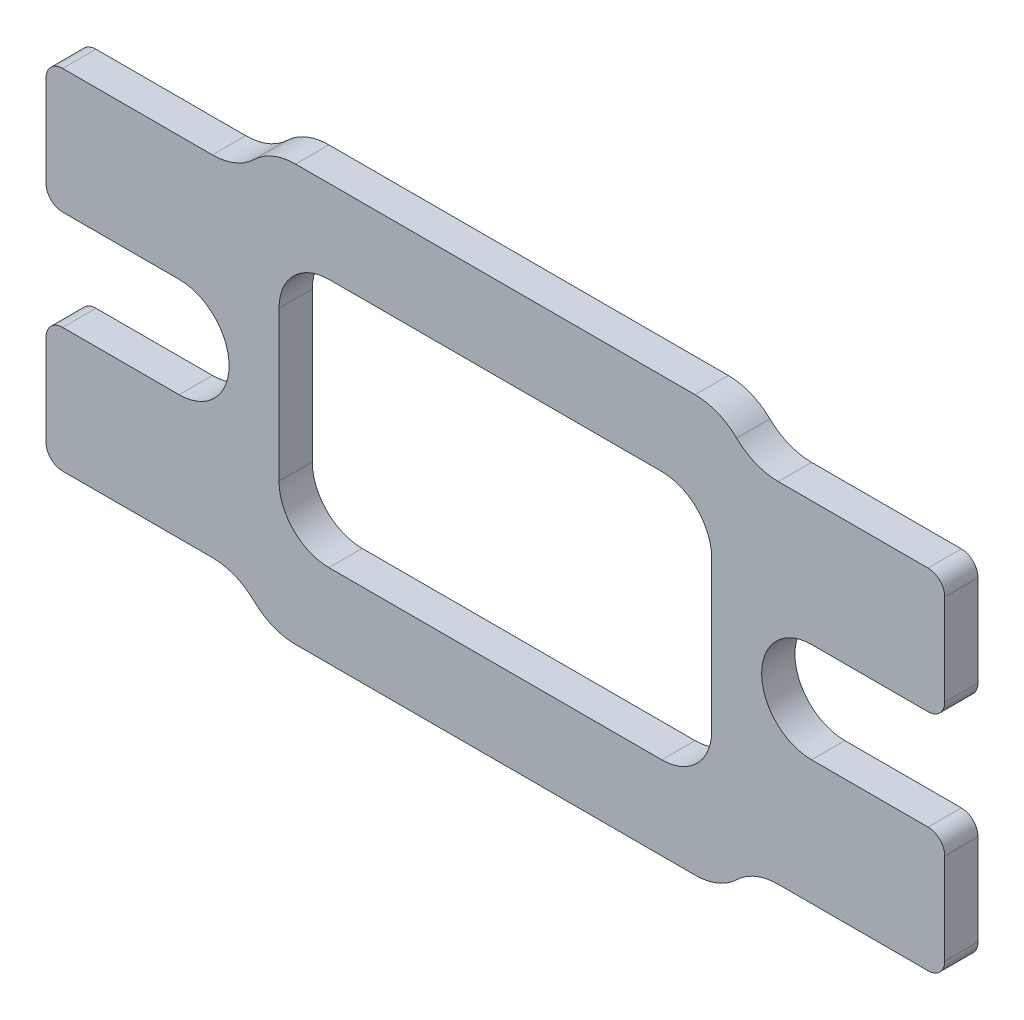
ISO-10303-21;
HEADER;
FILE_DESCRIPTION(('STEP AP214'),'2;1');
FILE_NAME('part.step','',(''),(''),'','','');
FILE_SCHEMA(('AUTOMOTIVE_DESIGN { 1 0 10303 214 1 1 1 1 }'));
ENDSEC;
DATA;
#1=APPLICATION_CONTEXT('core data for automotive mechanical design processes');
#2=APPLICATION_PROTOCOL_DEFINITION('international standard','automotive_design',2000,#1);
#3=PRODUCT_CONTEXT('',#1,'mechanical');
#4=PRODUCT('Part','Part','',(#3));
#5=PRODUCT_RELATED_PRODUCT_CATEGORY('part','',(#4));
#6=PRODUCT_DEFINITION_FORMATION('','',#4);
#7=PRODUCT_DEFINITION_CONTEXT('part definition',#1,'design');
#8=PRODUCT_DEFINITION('design','',#6,#7);
#9=PRODUCT_DEFINITION_SHAPE('','',#8);
#10=(LENGTH_UNIT() NAMED_UNIT(*) SI_UNIT(.MILLI.,.METRE.));
#11=(NAMED_UNIT(*) PLANE_ANGLE_UNIT() SI_UNIT($,.RADIAN.));
#12=(NAMED_UNIT(*) SI_UNIT($,.STERADIAN.) SOLID_ANGLE_UNIT());
#13=UNCERTAINTY_MEASURE_WITH_UNIT(LENGTH_MEASURE(1.E-05),#10,'distance_accuracy_value','');
#14=(GEOMETRIC_REPRESENTATION_CONTEXT(3) GLOBAL_UNCERTAINTY_ASSIGNED_CONTEXT((#13)) GLOBAL_UNIT_ASSIGNED_CONTEXT((#10,
#11,#12)) REPRESENTATION_CONTEXT('',''));
#15=CARTESIAN_POINT('',(0.,0.,0.));
#16=DIRECTION('',(0.,0.,1.));
#17=DIRECTION('',(1.,0.,0.));
#18=AXIS2_PLACEMENT_3D('',#15,#16,#17);
#19=CARTESIAN_POINT('',(12.,-73.4029971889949,2.));
#20=DIRECTION('',(0.,0.,1.));
#21=DIRECTION('',(1.,0.,0.));
#22=AXIS2_PLACEMENT_3D('',#19,#20,#21);
#23=PLANE('',#22);
#24=CARTESIAN_POINT('',(12.,-73.4029971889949,2.));
#25=DIRECTION('',(0.,0.,1.));
#26=DIRECTION('',(1.,0.,0.));
#27=AXIS2_PLACEMENT_3D('',#24,#25,#26);
#28=CIRCLE('',#27,3.59700281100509);
#29=CARTESIAN_POINT('',(12.,-77.,2.));
#30=VERTEX_POINT('',#29);
#31=CARTESIAN_POINT('',(14.5,-75.9891969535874,2.));
#32=VERTEX_POINT('',#31);
#33=EDGE_CURVE('E355',#30,#32,#28,.T.);
#34=ORIENTED_EDGE('',*,*,#33,.T.);
#35=CARTESIAN_POINT('',(17.,-78.57539671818,2.));
#36=DIRECTION('',(0.,0.,-1.));
#37=DIRECTION('',(1.,0.,0.));
#38=AXIS2_PLACEMENT_3D('',#35,#36,#37);
#39=CIRCLE('',#38,3.59700281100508);
#40=CARTESIAN_POINT('',(17.,-74.9783939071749,2.));
#41=VERTEX_POINT('',#40);
#42=EDGE_CURVE('E358',#32,#41,#39,.T.);
#43=ORIENTED_EDGE('',*,*,#42,.T.);
#44=DIRECTION('',(1.,0.,0.));
#45=VECTOR('',#44,1.);
#46=CARTESIAN_POINT('',(17.,-74.9783939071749,2.));
#47=LINE('',#46,#45);
#48=CARTESIAN_POINT('',(26.,-74.9783939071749,2.));
#49=VERTEX_POINT('',#48);
#50=EDGE_CURVE('E361',#41,#49,#47,.T.);
#51=ORIENTED_EDGE('',*,*,#50,.T.);
#52=CARTESIAN_POINT('',(26.,-73.9783939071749,2.));
#53=DIRECTION('',(0.,0.,1.));
#54=DIRECTION('',(1.,0.,0.));
#55=AXIS2_PLACEMENT_3D('',#52,#53,#54);
#56=CIRCLE('',#55,1.);
#57=CARTESIAN_POINT('',(27.,-73.9783939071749,2.));
#58=VERTEX_POINT('',#57);
#59=EDGE_CURVE('E363',#49,#58,#56,.T.);
#60=ORIENTED_EDGE('',*,*,#59,.T.);
#61=DIRECTION('',(0.,1.,0.));
#62=VECTOR('',#61,1.);
#63=CARTESIAN_POINT('',(27.,-73.9783939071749,2.));
#64=LINE('',#63,#62);
#65=CARTESIAN_POINT('',(27.,-68.5,2.));
#66=VERTEX_POINT('',#65);
#67=EDGE_CURVE('E365',#58,#66,#64,.T.);
#68=ORIENTED_EDGE('',*,*,#67,.T.);
#69=CARTESIAN_POINT('',(26.,-68.5,2.));
#70=DIRECTION('',(0.,0.,1.));
#71=DIRECTION('',(1.,0.,0.));
#72=AXIS2_PLACEMENT_3D('',#69,#70,#71);
#73=CIRCLE('',#72,0.999999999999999);
#74=CARTESIAN_POINT('',(26.,-67.5,2.));
#75=VERTEX_POINT('',#74);
#76=EDGE_CURVE('E367',#66,#75,#73,.T.);
#77=ORIENTED_EDGE('',*,*,#76,.T.);
#78=DIRECTION('',(-1.,0.,0.));
#79=VECTOR('',#78,1.);
#80=CARTESIAN_POINT('',(26.,-67.5,2.));
#81=LINE('',#80,#79);
#82=CARTESIAN_POINT('',(19.,-67.5,2.));
#83=VERTEX_POINT('',#82);
#84=EDGE_CURVE('E369',#75,#83,#81,.T.);
#85=ORIENTED_EDGE('',*,*,#84,.T.);
#86=CARTESIAN_POINT('',(19.,-64.5,2.));
#87=DIRECTION('',(0.,0.,-1.));
#88=DIRECTION('',(1.,0.,0.));
#89=AXIS2_PLACEMENT_3D('',#86,#87,#88);
#90=CIRCLE('',#89,3.);
#91=CARTESIAN_POINT('',(19.,-61.5,2.));
#92=VERTEX_POINT('',#91);
#93=EDGE_CURVE('E371',#83,#92,#90,.T.);
#94=ORIENTED_EDGE('',*,*,#93,.T.);
#95=DIRECTION('',(1.,0.,0.));
#96=VECTOR('',#95,1.);
#97=CARTESIAN_POINT('',(19.,-61.5,2.));
#98=LINE('',#97,#96);
#99=CARTESIAN_POINT('',(26.,-61.5,2.));
#100=VERTEX_POINT('',#99);
#101=EDGE_CURVE('E373',#92,#100,#98,.T.);
#102=ORIENTED_EDGE('',*,*,#101,.T.);
#103=CARTESIAN_POINT('',(26.,-60.5,2.));
#104=DIRECTION('',(0.,0.,1.));
#105=DIRECTION('',(1.,0.,0.));
#106=AXIS2_PLACEMENT_3D('',#103,#104,#105);
#107=CIRCLE('',#106,0.999999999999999);
#108=CARTESIAN_POINT('',(27.,-60.5,2.));
#109=VERTEX_POINT('',#108);
#110=EDGE_CURVE('E375',#100,#109,#107,.T.);
#111=ORIENTED_EDGE('',*,*,#110,.T.);
#112=DIRECTION('',(0.,1.,0.));
#113=VECTOR('',#112,1.);
#114=CARTESIAN_POINT('',(27.,-60.5,2.));
#115=LINE('',#114,#113);
#116=CARTESIAN_POINT('',(27.,-55.0216060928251,2.));
#117=VERTEX_POINT('',#116);
#118=EDGE_CURVE('E377',#109,#117,#115,.T.);
#119=ORIENTED_EDGE('',*,*,#118,.T.);
#120=CARTESIAN_POINT('',(26.,-55.0216060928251,2.));
#121=DIRECTION('',(0.,0.,1.));
#122=DIRECTION('',(1.,0.,0.));
#123=AXIS2_PLACEMENT_3D('',#120,#121,#122);
#124=CIRCLE('',#123,1.);
#125=CARTESIAN_POINT('',(26.,-54.0216060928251,2.));
#126=VERTEX_POINT('',#125);
#127=EDGE_CURVE('E379',#117,#126,#124,.T.);
#128=ORIENTED_EDGE('',*,*,#127,.T.);
#129=DIRECTION('',(-1.,0.,0.));
#130=VECTOR('',#129,1.);
#131=CARTESIAN_POINT('',(26.,-54.0216060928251,2.));
#132=LINE('',#131,#130);
#133=CARTESIAN_POINT('',(17.,-54.0216060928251,2.));
#134=VERTEX_POINT('',#133);
#135=EDGE_CURVE('E381',#126,#134,#132,.T.);
#136=ORIENTED_EDGE('',*,*,#135,.T.);
#137=CARTESIAN_POINT('',(17.,-50.42460328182,2.));
#138=DIRECTION('',(0.,0.,-1.));
#139=DIRECTION('',(1.,0.,0.));
#140=AXIS2_PLACEMENT_3D('',#137,#138,#139);
#141=CIRCLE('',#140,3.59700281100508);
#142=CARTESIAN_POINT('',(14.5,-53.0108030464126,2.));
#143=VERTEX_POINT('',#142);
#144=EDGE_CURVE('E383',#134,#143,#141,.T.);
#145=ORIENTED_EDGE('',*,*,#144,.T.);
#146=CARTESIAN_POINT('',(12.,-55.5970028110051,2.));
#147=DIRECTION('',(0.,0.,1.));
#148=DIRECTION('',(1.,0.,0.));
#149=AXIS2_PLACEMENT_3D('',#146,#147,#148);
#150=CIRCLE('',#149,3.59700281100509);
#151=CARTESIAN_POINT('',(12.,-52.,2.));
#152=VERTEX_POINT('',#151);
#153=EDGE_CURVE('E385',#143,#152,#150,.T.);
#154=ORIENTED_EDGE('',*,*,#153,.T.);
#155=DIRECTION('',(-1.,0.,0.));
#156=VECTOR('',#155,1.);
#157=CARTESIAN_POINT('',(12.,-52.,2.));
#158=LINE('',#157,#156);
#159=CARTESIAN_POINT('',(-12.,-52.,2.));
#160=VERTEX_POINT('',#159);
#161=EDGE_CURVE('E387',#152,#160,#158,.T.);
#162=ORIENTED_EDGE('',*,*,#161,.T.);
#163=CARTESIAN_POINT('',(-12.,-55.5970028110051,2.));
#164=DIRECTION('',(0.,0.,1.));
#165=DIRECTION('',(1.,0.,0.));
#166=AXIS2_PLACEMENT_3D('',#163,#164,#165);
#167=CIRCLE('',#166,3.59700281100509);
#168=CARTESIAN_POINT('',(-14.5,-53.0108030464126,2.));
#169=VERTEX_POINT('',#168);
#170=EDGE_CURVE('E389',#160,#169,#167,.T.);
#171=ORIENTED_EDGE('',*,*,#170,.T.);
#172=CARTESIAN_POINT('',(-17.,-50.42460328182,2.));
#173=DIRECTION('',(0.,0.,-1.));
#174=DIRECTION('',(1.,0.,0.));
#175=AXIS2_PLACEMENT_3D('',#172,#173,#174);
#176=CIRCLE('',#175,3.59700281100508);
#177=CARTESIAN_POINT('',(-17.,-54.0216060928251,2.));
#178=VERTEX_POINT('',#177);
#179=EDGE_CURVE('E391',#169,#178,#176,.T.);
#180=ORIENTED_EDGE('',*,*,#179,.T.);
#181=DIRECTION('',(-1.,0.,0.));
#182=VECTOR('',#181,1.);
#183=CARTESIAN_POINT('',(-17.,-54.0216060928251,2.));
#184=LINE('',#183,#182);
#185=CARTESIAN_POINT('',(-26.,-54.0216060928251,2.));
#186=VERTEX_POINT('',#185);
#187=EDGE_CURVE('E393',#178,#186,#184,.T.);
#188=ORIENTED_EDGE('',*,*,#187,.T.);
#189=CARTESIAN_POINT('',(-26.,-55.0216060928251,2.));
#190=DIRECTION('',(0.,0.,1.));
#191=DIRECTION('',(1.,0.,0.));
#192=AXIS2_PLACEMENT_3D('',#189,#190,#191);
#193=CIRCLE('',#192,1.);
#194=CARTESIAN_POINT('',(-27.,-55.0216060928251,2.));
#195=VERTEX_POINT('',#194);
#196=EDGE_CURVE('E395',#186,#195,#193,.T.);
#197=ORIENTED_EDGE('',*,*,#196,.T.);
#198=DIRECTION('',(0.,-1.,0.));
#199=VECTOR('',#198,1.);
#200=CARTESIAN_POINT('',(-27.,-55.0216060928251,2.));
#201=LINE('',#200,#199);
#202=CARTESIAN_POINT('',(-27.,-60.5,2.));
#203=VERTEX_POINT('',#202);
#204=EDGE_CURVE('E397',#195,#203,#201,.T.);
#205=ORIENTED_EDGE('',*,*,#204,.T.);
#206=CARTESIAN_POINT('',(-26.,-60.5,2.));
#207=DIRECTION('',(0.,0.,1.));
#208=DIRECTION('',(1.,0.,0.));
#209=AXIS2_PLACEMENT_3D('',#206,#207,#208);
#210=CIRCLE('',#209,1.00000000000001);
#211=CARTESIAN_POINT('',(-26.,-61.5,2.));
#212=VERTEX_POINT('',#211);
#213=EDGE_CURVE('E399',#203,#212,#210,.T.);
#214=ORIENTED_EDGE('',*,*,#213,.T.);
#215=DIRECTION('',(1.,0.,0.));
#216=VECTOR('',#215,1.);
#217=CARTESIAN_POINT('',(-26.,-61.5,2.));
#218=LINE('',#217,#216);
#219=CARTESIAN_POINT('',(-19.,-61.5,2.));
#220=VERTEX_POINT('',#219);
#221=EDGE_CURVE('E401',#212,#220,#218,.T.);
#222=ORIENTED_EDGE('',*,*,#221,.T.);
#223=CARTESIAN_POINT('',(-19.,-64.5,2.));
#224=DIRECTION('',(0.,0.,-1.));
#225=DIRECTION('',(1.,0.,0.));
#226=AXIS2_PLACEMENT_3D('',#223,#224,#225);
#227=CIRCLE('',#226,3.);
#228=CARTESIAN_POINT('',(-19.,-67.5,2.));
#229=VERTEX_POINT('',#228);
#230=EDGE_CURVE('E403',#220,#229,#227,.T.);
#231=ORIENTED_EDGE('',*,*,#230,.T.);
#232=DIRECTION('',(-1.,0.,0.));
#233=VECTOR('',#232,1.);
#234=CARTESIAN_POINT('',(-19.,-67.5,2.));
#235=LINE('',#234,#233);
#236=CARTESIAN_POINT('',(-26.,-67.5,2.));
#237=VERTEX_POINT('',#236);
#238=EDGE_CURVE('E405',#229,#237,#235,.T.);
#239=ORIENTED_EDGE('',*,*,#238,.T.);
#240=CARTESIAN_POINT('',(-26.,-68.5,2.));
#241=DIRECTION('',(0.,0.,1.));
#242=DIRECTION('',(1.,0.,0.));
#243=AXIS2_PLACEMENT_3D('',#240,#241,#242);
#244=CIRCLE('',#243,0.999999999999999);
#245=CARTESIAN_POINT('',(-27.,-68.5,2.));
#246=VERTEX_POINT('',#245);
#247=EDGE_CURVE('E407',#237,#246,#244,.T.);
#248=ORIENTED_EDGE('',*,*,#247,.T.);
#249=DIRECTION('',(0.,-1.,0.));
#250=VECTOR('',#249,1.);
#251=CARTESIAN_POINT('',(-27.,-68.5,2.));
#252=LINE('',#251,#250);
#253=CARTESIAN_POINT('',(-27.,-73.9783939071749,2.));
#254=VERTEX_POINT('',#253);
#255=EDGE_CURVE('E409',#246,#254,#252,.T.);
#256=ORIENTED_EDGE('',*,*,#255,.T.);
#257=CARTESIAN_POINT('',(-26.,-73.9783939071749,2.));
#258=DIRECTION('',(0.,0.,1.));
#259=DIRECTION('',(1.,0.,0.));
#260=AXIS2_PLACEMENT_3D('',#257,#258,#259);
#261=CIRCLE('',#260,1.);
#262=CARTESIAN_POINT('',(-26.,-74.9783939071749,2.));
#263=VERTEX_POINT('',#262);
#264=EDGE_CURVE('E411',#254,#263,#261,.T.);
#265=ORIENTED_EDGE('',*,*,#264,.T.);
#266=DIRECTION('',(1.,0.,0.));
#267=VECTOR('',#266,1.);
#268=CARTESIAN_POINT('',(-26.,-74.9783939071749,2.));
#269=LINE('',#268,#267);
#270=CARTESIAN_POINT('',(-17.,-74.9783939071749,2.));
#271=VERTEX_POINT('',#270);
#272=EDGE_CURVE('E413',#263,#271,#269,.T.);
#273=ORIENTED_EDGE('',*,*,#272,.T.);
#274=CARTESIAN_POINT('',(-17.,-78.57539671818,2.));
#275=DIRECTION('',(0.,0.,-1.));
#276=DIRECTION('',(1.,0.,0.));
#277=AXIS2_PLACEMENT_3D('',#274,#275,#276);
#278=CIRCLE('',#277,3.59700281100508);
#279=CARTESIAN_POINT('',(-14.5,-75.9891969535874,2.));
#280=VERTEX_POINT('',#279);
#281=EDGE_CURVE('E415',#271,#280,#278,.T.);
#282=ORIENTED_EDGE('',*,*,#281,.T.);
#283=CARTESIAN_POINT('',(-12.,-73.4029971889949,2.));
#284=DIRECTION('',(0.,0.,1.));
#285=DIRECTION('',(1.,0.,0.));
#286=AXIS2_PLACEMENT_3D('',#283,#284,#285);
#287=CIRCLE('',#286,3.59700281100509);
#288=CARTESIAN_POINT('',(-12.,-77.,2.));
#289=VERTEX_POINT('',#288);
#290=EDGE_CURVE('E417',#280,#289,#287,.T.);
#291=ORIENTED_EDGE('',*,*,#290,.T.);
#292=DIRECTION('',(1.,0.,0.));
#293=VECTOR('',#292,1.);
#294=CARTESIAN_POINT('',(-12.,-77.,2.));
#295=LINE('',#294,#293);
#296=EDGE_CURVE('E419',#289,#30,#295,.T.);
#297=ORIENTED_EDGE('',*,*,#296,.T.);
#298=EDGE_LOOP('',(#34,#43,#51,#60,#68,#77,#85,#94,#102,#111,#119,#128,#136,#145,#154,#162,#171,
#180,#188,#197,#205,#214,#222,#231,#239,#248,#256,#265,#273,#282,#291,#297));
#299=FACE_BOUND('',#298,.T.);
#300=DIRECTION('',(0.,1.,0.));
#301=VECTOR('',#300,1.);
#302=CARTESIAN_POINT('',(13.,-69.,2.));
#303=LINE('',#302,#301);
#304=CARTESIAN_POINT('',(13.,-69.,2.));
#305=VERTEX_POINT('',#304);
#306=CARTESIAN_POINT('',(13.,-60.,2.));
#307=VERTEX_POINT('',#306);
#308=EDGE_CURVE('E298',#305,#307,#303,.T.);
#309=ORIENTED_EDGE('',*,*,#308,.F.);
#310=CARTESIAN_POINT('',(9.99999999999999,-69.,2.));
#311=DIRECTION('',(0.,0.,1.));
#312=DIRECTION('',(1.,0.,0.));
#313=AXIS2_PLACEMENT_3D('',#310,#311,#312);
#314=CIRCLE('',#313,3.);
#315=CARTESIAN_POINT('',(9.99999999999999,-72.,2.));
#316=VERTEX_POINT('',#315);
#317=EDGE_CURVE('E290',#316,#305,#314,.T.);
#318=ORIENTED_EDGE('',*,*,#317,.F.);
#319=DIRECTION('',(1.,0.,0.));
#320=VECTOR('',#319,1.);
#321=CARTESIAN_POINT('',(9.99999999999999,-72.,2.));
#322=LINE('',#321,#320);
#323=CARTESIAN_POINT('',(-9.99999999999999,-72.,2.));
#324=VERTEX_POINT('',#323);
#325=EDGE_CURVE('E323',#324,#316,#322,.T.);
#326=ORIENTED_EDGE('',*,*,#325,.F.);
#327=CARTESIAN_POINT('',(-9.99999999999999,-69.,2.));
#328=DIRECTION('',(0.,0.,1.));
#329=DIRECTION('',(1.,0.,0.));
#330=AXIS2_PLACEMENT_3D('',#327,#328,#329);
#331=CIRCLE('',#330,3.);
#332=CARTESIAN_POINT('',(-13.,-69.,2.));
#333=VERTEX_POINT('',#332);
#334=EDGE_CURVE('E321',#333,#324,#331,.T.);
#335=ORIENTED_EDGE('',*,*,#334,.F.);
#336=DIRECTION('',(0.,-1.,0.));
#337=VECTOR('',#336,1.);
#338=CARTESIAN_POINT('',(-13.,-69.,2.));
#339=LINE('',#338,#337);
#340=CARTESIAN_POINT('',(-13.,-60.,2.));
#341=VERTEX_POINT('',#340);
#342=EDGE_CURVE('E319',#341,#333,#339,.T.);
#343=ORIENTED_EDGE('',*,*,#342,.F.);
#344=CARTESIAN_POINT('',(-9.99999999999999,-60.,2.));
#345=DIRECTION('',(0.,0.,1.));
#346=DIRECTION('',(1.,0.,0.));
#347=AXIS2_PLACEMENT_3D('',#344,#345,#346);
#348=CIRCLE('',#347,3.);
#349=CARTESIAN_POINT('',(-9.99999999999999,-57.,2.));
#350=VERTEX_POINT('',#349);
#351=EDGE_CURVE('E317',#350,#341,#348,.T.);
#352=ORIENTED_EDGE('',*,*,#351,.F.);
#353=DIRECTION('',(-1.,0.,0.));
#354=VECTOR('',#353,1.);
#355=CARTESIAN_POINT('',(9.99999999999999,-57.,2.));
#356=LINE('',#355,#354);
#357=CARTESIAN_POINT('',(9.99999999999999,-57.,2.));
#358=VERTEX_POINT('',#357);
#359=EDGE_CURVE('E313',#358,#350,#356,.T.);
#360=ORIENTED_EDGE('',*,*,#359,.F.);
#361=CARTESIAN_POINT('',(9.99999999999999,-60.,2.));
#362=DIRECTION('',(0.,0.,1.));
#363=DIRECTION('',(1.,0.,0.));
#364=AXIS2_PLACEMENT_3D('',#361,#362,#363);
#365=CIRCLE('',#364,3.);
#366=EDGE_CURVE('E311',#307,#358,#365,.T.);
#367=ORIENTED_EDGE('',*,*,#366,.F.);
#368=EDGE_LOOP('',(#309,#318,#326,#335,#343,#352,#360,#367));
#369=FACE_BOUND('',#368,.T.);
#370=ADVANCED_FACE('F33',(#299,#369),#23,.T.);
#371=CARTESIAN_POINT('',(12.,-73.4029971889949,0.));
#372=DIRECTION('',(0.,0.,1.));
#373=DIRECTION('',(1.,0.,0.));
#374=AXIS2_PLACEMENT_3D('',#371,#372,#373);
#375=PLANE('',#374);
#376=CARTESIAN_POINT('',(12.,-73.4029971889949,0.));
#377=DIRECTION('',(0.,0.,1.));
#378=DIRECTION('',(1.,0.,0.));
#379=AXIS2_PLACEMENT_3D('',#376,#377,#378);
#380=CIRCLE('',#379,3.59700281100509);
#381=CARTESIAN_POINT('',(12.,-77.,0.));
#382=VERTEX_POINT('',#381);
#383=CARTESIAN_POINT('',(14.5,-75.9891969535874,0.));
#384=VERTEX_POINT('',#383);
#385=EDGE_CURVE('E306',#382,#384,#380,.T.);
#386=ORIENTED_EDGE('',*,*,#385,.F.);
#387=DIRECTION('',(1.,0.,0.));
#388=VECTOR('',#387,1.);
#389=CARTESIAN_POINT('',(-12.,-77.,0.));
#390=LINE('',#389,#388);
#391=CARTESIAN_POINT('',(-12.,-77.,0.));
#392=VERTEX_POINT('',#391);
#393=EDGE_CURVE('E359',#392,#382,#390,.T.);
#394=ORIENTED_EDGE('',*,*,#393,.F.);
#395=CARTESIAN_POINT('',(-12.,-73.4029971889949,0.));
#396=DIRECTION('',(0.,0.,1.));
#397=DIRECTION('',(1.,0.,0.));
#398=AXIS2_PLACEMENT_3D('',#395,#396,#397);
#399=CIRCLE('',#398,3.59700281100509);
#400=CARTESIAN_POINT('',(-14.5,-75.9891969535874,0.));
#401=VERTEX_POINT('',#400);
#402=EDGE_CURVE('E482',#401,#392,#399,.T.);
#403=ORIENTED_EDGE('',*,*,#402,.F.);
#404=CARTESIAN_POINT('',(-17.,-78.57539671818,0.));
#405=DIRECTION('',(0.,0.,-1.));
#406=DIRECTION('',(1.,0.,0.));
#407=AXIS2_PLACEMENT_3D('',#404,#405,#406);
#408=CIRCLE('',#407,3.59700281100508);
#409=CARTESIAN_POINT('',(-17.,-74.9783939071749,0.));
#410=VERTEX_POINT('',#409);
#411=EDGE_CURVE('E480',#410,#401,#408,.T.);
#412=ORIENTED_EDGE('',*,*,#411,.F.);
#413=DIRECTION('',(1.,0.,0.));
#414=VECTOR('',#413,1.);
#415=CARTESIAN_POINT('',(-26.,-74.9783939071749,0.));
#416=LINE('',#415,#414);
#417=CARTESIAN_POINT('',(-26.,-74.9783939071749,0.));
#418=VERTEX_POINT('',#417);
#419=EDGE_CURVE('E478',#418,#410,#416,.T.);
#420=ORIENTED_EDGE('',*,*,#419,.F.);
#421=CARTESIAN_POINT('',(-26.,-73.9783939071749,0.));
#422=DIRECTION('',(0.,0.,1.));
#423=DIRECTION('',(1.,0.,0.));
#424=AXIS2_PLACEMENT_3D('',#421,#422,#423);
#425=CIRCLE('',#424,1.);
#426=CARTESIAN_POINT('',(-27.,-73.9783939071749,0.));
#427=VERTEX_POINT('',#426);
#428=EDGE_CURVE('E476',#427,#418,#425,.T.);
#429=ORIENTED_EDGE('',*,*,#428,.F.);
#430=DIRECTION('',(0.,-1.,0.));
#431=VECTOR('',#430,1.);
#432=CARTESIAN_POINT('',(-27.,-68.5,0.));
#433=LINE('',#432,#431);
#434=CARTESIAN_POINT('',(-27.,-68.5,0.));
#435=VERTEX_POINT('',#434);
#436=EDGE_CURVE('E474',#435,#427,#433,.T.);
#437=ORIENTED_EDGE('',*,*,#436,.F.);
#438=CARTESIAN_POINT('',(-26.,-68.5,0.));
#439=DIRECTION('',(0.,0.,1.));
#440=DIRECTION('',(1.,0.,0.));
#441=AXIS2_PLACEMENT_3D('',#438,#439,#440);
#442=CIRCLE('',#441,0.999999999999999);
#443=CARTESIAN_POINT('',(-26.,-67.5,0.));
#444=VERTEX_POINT('',#443);
#445=EDGE_CURVE('E472',#444,#435,#442,.T.);
#446=ORIENTED_EDGE('',*,*,#445,.F.);
#447=DIRECTION('',(-1.,0.,0.));
#448=VECTOR('',#447,1.);
#449=CARTESIAN_POINT('',(-19.,-67.5,0.));
#450=LINE('',#449,#448);
#451=CARTESIAN_POINT('',(-19.,-67.5,0.));
#452=VERTEX_POINT('',#451);
#453=EDGE_CURVE('E470',#452,#444,#450,.T.);
#454=ORIENTED_EDGE('',*,*,#453,.F.);
#455=CARTESIAN_POINT('',(-19.,-64.5,0.));
#456=DIRECTION('',(0.,0.,-1.));
#457=DIRECTION('',(1.,0.,0.));
#458=AXIS2_PLACEMENT_3D('',#455,#456,#457);
#459=CIRCLE('',#458,3.);
#460=CARTESIAN_POINT('',(-19.,-61.5,0.));
#461=VERTEX_POINT('',#460);
#462=EDGE_CURVE('E468',#461,#452,#459,.T.);
#463=ORIENTED_EDGE('',*,*,#462,.F.);
#464=DIRECTION('',(1.,0.,0.));
#465=VECTOR('',#464,1.);
#466=CARTESIAN_POINT('',(-26.,-61.5,0.));
#467=LINE('',#466,#465);
#468=CARTESIAN_POINT('',(-26.,-61.5,0.));
#469=VERTEX_POINT('',#468);
#470=EDGE_CURVE('E466',#469,#461,#467,.T.);
#471=ORIENTED_EDGE('',*,*,#470,.F.);
#472=CARTESIAN_POINT('',(-26.,-60.5,0.));
#473=DIRECTION('',(0.,0.,1.));
#474=DIRECTION('',(1.,0.,0.));
#475=AXIS2_PLACEMENT_3D('',#472,#473,#474);
#476=CIRCLE('',#475,1.00000000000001);
#477=CARTESIAN_POINT('',(-27.,-60.5,0.));
#478=VERTEX_POINT('',#477);
#479=EDGE_CURVE('E464',#478,#469,#476,.T.);
#480=ORIENTED_EDGE('',*,*,#479,.F.);
#481=DIRECTION('',(0.,-1.,0.));
#482=VECTOR('',#481,1.);
#483=CARTESIAN_POINT('',(-27.,-55.0216060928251,0.));
#484=LINE('',#483,#482);
#485=CARTESIAN_POINT('',(-27.,-55.0216060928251,0.));
#486=VERTEX_POINT('',#485);
#487=EDGE_CURVE('E462',#486,#478,#484,.T.);
#488=ORIENTED_EDGE('',*,*,#487,.F.);
#489=CARTESIAN_POINT('',(-26.,-55.0216060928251,0.));
#490=DIRECTION('',(0.,0.,1.));
#491=DIRECTION('',(1.,0.,0.));
#492=AXIS2_PLACEMENT_3D('',#489,#490,#491);
#493=CIRCLE('',#492,1.);
#494=CARTESIAN_POINT('',(-26.,-54.0216060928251,0.));
#495=VERTEX_POINT('',#494);
#496=EDGE_CURVE('E460',#495,#486,#493,.T.);
#497=ORIENTED_EDGE('',*,*,#496,.F.);
#498=DIRECTION('',(-1.,0.,0.));
#499=VECTOR('',#498,1.);
#500=CARTESIAN_POINT('',(-17.,-54.0216060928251,0.));
#501=LINE('',#500,#499);
#502=CARTESIAN_POINT('',(-17.,-54.0216060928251,0.));
#503=VERTEX_POINT('',#502);
#504=EDGE_CURVE('E458',#503,#495,#501,.T.);
#505=ORIENTED_EDGE('',*,*,#504,.F.);
#506=CARTESIAN_POINT('',(-17.,-50.42460328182,0.));
#507=DIRECTION('',(0.,0.,-1.));
#508=DIRECTION('',(1.,0.,0.));
#509=AXIS2_PLACEMENT_3D('',#506,#507,#508);
#510=CIRCLE('',#509,3.59700281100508);
#511=CARTESIAN_POINT('',(-14.5,-53.0108030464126,0.));
#512=VERTEX_POINT('',#511);
#513=EDGE_CURVE('E456',#512,#503,#510,.T.);
#514=ORIENTED_EDGE('',*,*,#513,.F.);
#515=CARTESIAN_POINT('',(-12.,-55.5970028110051,0.));
#516=DIRECTION('',(0.,0.,1.));
#517=DIRECTION('',(1.,0.,0.));
#518=AXIS2_PLACEMENT_3D('',#515,#516,#517);
#519=CIRCLE('',#518,3.59700281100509);
#520=CARTESIAN_POINT('',(-12.,-52.,0.));
#521=VERTEX_POINT('',#520);
#522=EDGE_CURVE('E454',#521,#512,#519,.T.);
#523=ORIENTED_EDGE('',*,*,#522,.F.);
#524=DIRECTION('',(-1.,0.,0.));
#525=VECTOR('',#524,1.);
#526=CARTESIAN_POINT('',(12.,-52.,0.));
#527=LINE('',#526,#525);
#528=CARTESIAN_POINT('',(12.,-52.,0.));
#529=VERTEX_POINT('',#528);
#530=EDGE_CURVE('E452',#529,#521,#527,.T.);
#531=ORIENTED_EDGE('',*,*,#530,.F.);
#532=CARTESIAN_POINT('',(12.,-55.5970028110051,0.));
#533=DIRECTION('',(0.,0.,1.));
#534=DIRECTION('',(1.,0.,0.));
#535=AXIS2_PLACEMENT_3D('',#532,#533,#534);
#536=CIRCLE('',#535,3.59700281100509);
#537=CARTESIAN_POINT('',(14.5,-53.0108030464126,0.));
#538=VERTEX_POINT('',#537);
#539=EDGE_CURVE('E450',#538,#529,#536,.T.);
#540=ORIENTED_EDGE('',*,*,#539,.F.);
#541=CARTESIAN_POINT('',(17.,-50.42460328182,0.));
#542=DIRECTION('',(0.,0.,-1.));
#543=DIRECTION('',(1.,0.,0.));
#544=AXIS2_PLACEMENT_3D('',#541,#542,#543);
#545=CIRCLE('',#544,3.59700281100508);
#546=CARTESIAN_POINT('',(17.,-54.0216060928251,0.));
#547=VERTEX_POINT('',#546);
#548=EDGE_CURVE('E448',#547,#538,#545,.T.);
#549=ORIENTED_EDGE('',*,*,#548,.F.);
#550=DIRECTION('',(-1.,0.,0.));
#551=VECTOR('',#550,1.);
#552=CARTESIAN_POINT('',(26.,-54.0216060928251,0.));
#553=LINE('',#552,#551);
#554=CARTESIAN_POINT('',(26.,-54.0216060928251,0.));
#555=VERTEX_POINT('',#554);
#556=EDGE_CURVE('E446',#555,#547,#553,.T.);
#557=ORIENTED_EDGE('',*,*,#556,.F.);
#558=CARTESIAN_POINT('',(26.,-55.0216060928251,0.));
#559=DIRECTION('',(0.,0.,1.));
#560=DIRECTION('',(1.,0.,0.));
#561=AXIS2_PLACEMENT_3D('',#558,#559,#560);
#562=CIRCLE('',#561,1.);
#563=CARTESIAN_POINT('',(27.,-55.0216060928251,0.));
#564=VERTEX_POINT('',#563);
#565=EDGE_CURVE('E444',#564,#555,#562,.T.);
#566=ORIENTED_EDGE('',*,*,#565,.F.);
#567=DIRECTION('',(0.,1.,0.));
#568=VECTOR('',#567,1.);
#569=CARTESIAN_POINT('',(27.,-60.5,0.));
#570=LINE('',#569,#568);
#571=CARTESIAN_POINT('',(27.,-60.5,0.));
#572=VERTEX_POINT('',#571);
#573=EDGE_CURVE('E442',#572,#564,#570,.T.);
#574=ORIENTED_EDGE('',*,*,#573,.F.);
#575=CARTESIAN_POINT('',(26.,-60.5,0.));
#576=DIRECTION('',(0.,0.,1.));
#577=DIRECTION('',(1.,0.,0.));
#578=AXIS2_PLACEMENT_3D('',#575,#576,#577);
#579=CIRCLE('',#578,0.999999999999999);
#580=CARTESIAN_POINT('',(26.,-61.5,0.));
#581=VERTEX_POINT('',#580);
#582=EDGE_CURVE('E440',#581,#572,#579,.T.);
#583=ORIENTED_EDGE('',*,*,#582,.F.);
#584=DIRECTION('',(1.,0.,0.));
#585=VECTOR('',#584,1.);
#586=CARTESIAN_POINT('',(19.,-61.5,0.));
#587=LINE('',#586,#585);
#588=CARTESIAN_POINT('',(19.,-61.5,0.));
#589=VERTEX_POINT('',#588);
#590=EDGE_CURVE('E438',#589,#581,#587,.T.);
#591=ORIENTED_EDGE('',*,*,#590,.F.);
#592=CARTESIAN_POINT('',(19.,-64.5,0.));
#593=DIRECTION('',(0.,0.,-1.));
#594=DIRECTION('',(1.,0.,0.));
#595=AXIS2_PLACEMENT_3D('',#592,#593,#594);
#596=CIRCLE('',#595,3.);
#597=CARTESIAN_POINT('',(19.,-67.5,0.));
#598=VERTEX_POINT('',#597);
#599=EDGE_CURVE('E436',#598,#589,#596,.T.);
#600=ORIENTED_EDGE('',*,*,#599,.F.);
#601=DIRECTION('',(-1.,0.,0.));
#602=VECTOR('',#601,1.);
#603=CARTESIAN_POINT('',(26.,-67.5,0.));
#604=LINE('',#603,#602);
#605=CARTESIAN_POINT('',(26.,-67.5,0.));
#606=VERTEX_POINT('',#605);
#607=EDGE_CURVE('E434',#606,#598,#604,.T.);
#608=ORIENTED_EDGE('',*,*,#607,.F.);
#609=CARTESIAN_POINT('',(26.,-68.5,0.));
#610=DIRECTION('',(0.,0.,1.));
#611=DIRECTION('',(1.,0.,0.));
#612=AXIS2_PLACEMENT_3D('',#609,#610,#611);
#613=CIRCLE('',#612,0.999999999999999);
#614=CARTESIAN_POINT('',(27.,-68.5,0.));
#615=VERTEX_POINT('',#614);
#616=EDGE_CURVE('E432',#615,#606,#613,.T.);
#617=ORIENTED_EDGE('',*,*,#616,.F.);
#618=DIRECTION('',(0.,1.,0.));
#619=VECTOR('',#618,1.);
#620=CARTESIAN_POINT('',(27.,-73.9783939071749,0.));
#621=LINE('',#620,#619);
#622=CARTESIAN_POINT('',(27.,-73.9783939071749,0.));
#623=VERTEX_POINT('',#622);
#624=EDGE_CURVE('E430',#623,#615,#621,.T.);
#625=ORIENTED_EDGE('',*,*,#624,.F.);
#626=CARTESIAN_POINT('',(26.,-73.9783939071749,0.));
#627=DIRECTION('',(0.,0.,1.));
#628=DIRECTION('',(1.,0.,0.));
#629=AXIS2_PLACEMENT_3D('',#626,#627,#628);
#630=CIRCLE('',#629,1.);
#631=CARTESIAN_POINT('',(26.,-74.9783939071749,0.));
#632=VERTEX_POINT('',#631);
#633=EDGE_CURVE('E428',#632,#623,#630,.T.);
#634=ORIENTED_EDGE('',*,*,#633,.F.);
#635=DIRECTION('',(1.,0.,0.));
#636=VECTOR('',#635,1.);
#637=CARTESIAN_POINT('',(17.,-74.9783939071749,0.));
#638=LINE('',#637,#636);
#639=CARTESIAN_POINT('',(17.,-74.9783939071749,0.));
#640=VERTEX_POINT('',#639);
#641=EDGE_CURVE('E426',#640,#632,#638,.T.);
#642=ORIENTED_EDGE('',*,*,#641,.F.);
#643=CARTESIAN_POINT('',(17.,-78.57539671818,0.));
#644=DIRECTION('',(0.,0.,-1.));
#645=DIRECTION('',(1.,0.,0.));
#646=AXIS2_PLACEMENT_3D('',#643,#644,#645);
#647=CIRCLE('',#646,3.59700281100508);
#648=EDGE_CURVE('E424',#384,#640,#647,.T.);
#649=ORIENTED_EDGE('',*,*,#648,.F.);
#650=EDGE_LOOP('',(#386,#394,#403,#412,#420,#429,#437,#446,#454,#463,#471,#480,#488,#497,#505,
#514,#523,#531,#540,#549,#557,#566,#574,#583,#591,#600,#608,#617,#625,#634,#642,#649));
#651=FACE_BOUND('',#650,.T.);
#652=CARTESIAN_POINT('',(9.99999999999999,-69.,0.));
#653=DIRECTION('',(0.,0.,1.));
#654=DIRECTION('',(1.,0.,0.));
#655=AXIS2_PLACEMENT_3D('',#652,#653,#654);
#656=CIRCLE('',#655,3.);
#657=CARTESIAN_POINT('',(9.99999999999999,-72.,0.));
#658=VERTEX_POINT('',#657);
#659=CARTESIAN_POINT('',(13.,-69.,0.));
#660=VERTEX_POINT('',#659);
#661=EDGE_CURVE('E56',#658,#660,#656,.T.);
#662=ORIENTED_EDGE('',*,*,#661,.T.);
#663=DIRECTION('',(0.,1.,0.));
#664=VECTOR('',#663,1.);
#665=CARTESIAN_POINT('',(13.,-69.,0.));
#666=LINE('',#665,#664);
#667=CARTESIAN_POINT('',(13.,-60.,0.));
#668=VERTEX_POINT('',#667);
#669=EDGE_CURVE('E305',#660,#668,#666,.T.);
#670=ORIENTED_EDGE('',*,*,#669,.T.);
#671=CARTESIAN_POINT('',(9.99999999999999,-60.,0.));
#672=DIRECTION('',(0.,0.,1.));
#673=DIRECTION('',(1.,0.,0.));
#674=AXIS2_PLACEMENT_3D('',#671,#672,#673);
#675=CIRCLE('',#674,3.);
#676=CARTESIAN_POINT('',(9.99999999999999,-57.,0.));
#677=VERTEX_POINT('',#676);
#678=EDGE_CURVE('E327',#668,#677,#675,.T.);
#679=ORIENTED_EDGE('',*,*,#678,.T.);
#680=DIRECTION('',(-1.,0.,0.));
#681=VECTOR('',#680,1.);
#682=CARTESIAN_POINT('',(9.99999999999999,-57.,0.));
#683=LINE('',#682,#681);
#684=CARTESIAN_POINT('',(-9.99999999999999,-57.,0.));
#685=VERTEX_POINT('',#684);
#686=EDGE_CURVE('E330',#677,#685,#683,.T.);
#687=ORIENTED_EDGE('',*,*,#686,.T.);
#688=CARTESIAN_POINT('',(-9.99999999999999,-60.,0.));
#689=DIRECTION('',(0.,0.,1.));
#690=DIRECTION('',(1.,0.,0.));
#691=AXIS2_PLACEMENT_3D('',#688,#689,#690);
#692=CIRCLE('',#691,3.);
#693=CARTESIAN_POINT('',(-13.,-60.,0.));
#694=VERTEX_POINT('',#693);
#695=EDGE_CURVE('E333',#685,#694,#692,.T.);
#696=ORIENTED_EDGE('',*,*,#695,.T.);
#697=DIRECTION('',(0.,-1.,0.));
#698=VECTOR('',#697,1.);
#699=CARTESIAN_POINT('',(-13.,-69.,0.));
#700=LINE('',#699,#698);
#701=CARTESIAN_POINT('',(-13.,-69.,0.));
#702=VERTEX_POINT('',#701);
#703=EDGE_CURVE('E336',#694,#702,#700,.T.);
#704=ORIENTED_EDGE('',*,*,#703,.T.);
#705=CARTESIAN_POINT('',(-9.99999999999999,-69.,0.));
#706=DIRECTION('',(0.,0.,1.));
#707=DIRECTION('',(1.,0.,0.));
#708=AXIS2_PLACEMENT_3D('',#705,#706,#707);
#709=CIRCLE('',#708,3.);
#710=CARTESIAN_POINT('',(-9.99999999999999,-72.,0.));
#711=VERTEX_POINT('',#710);
#712=EDGE_CURVE('E339',#702,#711,#709,.T.);
#713=ORIENTED_EDGE('',*,*,#712,.T.);
#714=DIRECTION('',(1.,0.,0.));
#715=VECTOR('',#714,1.);
#716=CARTESIAN_POINT('',(9.99999999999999,-72.,0.));
#717=LINE('',#716,#715);
#718=EDGE_CURVE('E299',#711,#658,#717,.T.);
#719=ORIENTED_EDGE('',*,*,#718,.T.);
#720=EDGE_LOOP('',(#662,#670,#679,#687,#696,#704,#713,#719));
#721=FACE_BOUND('',#720,.T.);
#722=ADVANCED_FACE('F584',(#651,#721),#375,.F.);
#723=CARTESIAN_POINT('',(12.,-73.4029971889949,2.));
#724=DIRECTION('',(0.,0.,-1.));
#725=DIRECTION('',(-1.,0.,0.));
#726=AXIS2_PLACEMENT_3D('',#723,#724,#725);
#727=CYLINDRICAL_SURFACE('',#726,3.59700281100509);
#728=ORIENTED_EDGE('',*,*,#385,.T.);
#729=DIRECTION('',(0.,0.,-1.));
#730=VECTOR('',#729,1.);
#731=CARTESIAN_POINT('',(14.5,-75.9891969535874,2.));
#732=LINE('',#731,#730);
#733=EDGE_CURVE('E11',#32,#384,#732,.T.);
#734=ORIENTED_EDGE('',*,*,#733,.F.);
#735=ORIENTED_EDGE('',*,*,#33,.F.);
#736=DIRECTION('',(0.,0.,-1.));
#737=VECTOR('',#736,1.);
#738=CARTESIAN_POINT('',(12.,-77.,2.));
#739=LINE('',#738,#737);
#740=EDGE_CURVE('E421',#30,#382,#739,.T.);
#741=ORIENTED_EDGE('',*,*,#740,.T.);
#742=EDGE_LOOP('',(#728,#734,#735,#741));
#743=FACE_BOUND('',#742,.T.);
#744=ADVANCED_FACE('F35',(#743),#727,.T.);
#745=CARTESIAN_POINT('',(17.,-78.57539671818,2.));
#746=DIRECTION('',(0.,0.,-1.));
#747=DIRECTION('',(-1.,0.,0.));
#748=AXIS2_PLACEMENT_3D('',#745,#746,#747);
#749=CYLINDRICAL_SURFACE('',#748,3.59700281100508);
#750=ORIENTED_EDGE('',*,*,#648,.T.);
#751=DIRECTION('',(0.,0.,-1.));
#752=VECTOR('',#751,1.);
#753=CARTESIAN_POINT('',(17.,-74.9783939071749,2.));
#754=LINE('',#753,#752);
#755=EDGE_CURVE('E41',#41,#640,#754,.T.);
#756=ORIENTED_EDGE('',*,*,#755,.F.);
#757=ORIENTED_EDGE('',*,*,#42,.F.);
#758=ORIENTED_EDGE('',*,*,#733,.T.);
#759=EDGE_LOOP('',(#750,#756,#757,#758));
#760=FACE_BOUND('',#759,.T.);
#761=ADVANCED_FACE('F601',(#760),#749,.F.);
#762=CARTESIAN_POINT('',(17.,-74.9783939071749,2.));
#763=DIRECTION('',(0.,1.,0.));
#764=DIRECTION('',(0.,0.,1.));
#765=AXIS2_PLACEMENT_3D('',#762,#763,#764);
#766=PLANE('',#765);
#767=ORIENTED_EDGE('',*,*,#641,.T.);
#768=DIRECTION('',(0.,0.,-1.));
#769=VECTOR('',#768,1.);
#770=CARTESIAN_POINT('',(26.,-74.9783939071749,2.));
#771=LINE('',#770,#769);
#772=EDGE_CURVE('E571',#49,#632,#771,.T.);
#773=ORIENTED_EDGE('',*,*,#772,.F.);
#774=ORIENTED_EDGE('',*,*,#50,.F.);
#775=ORIENTED_EDGE('',*,*,#755,.T.);
#776=EDGE_LOOP('',(#767,#773,#774,#775));
#777=FACE_BOUND('',#776,.T.);
#778=ADVANCED_FACE('F578',(#777),#766,.F.);
#779=CARTESIAN_POINT('',(26.,-73.9783939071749,2.));
#780=DIRECTION('',(0.,0.,-1.));
#781=DIRECTION('',(-1.,0.,0.));
#782=AXIS2_PLACEMENT_3D('',#779,#780,#781);
#783=CYLINDRICAL_SURFACE('',#782,1.);
#784=ORIENTED_EDGE('',*,*,#633,.T.);
#785=DIRECTION('',(0.,0.,-1.));
#786=VECTOR('',#785,1.);
#787=CARTESIAN_POINT('',(27.,-73.9783939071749,2.));
#788=LINE('',#787,#786);
#789=EDGE_CURVE('E568',#58,#623,#788,.T.);
#790=ORIENTED_EDGE('',*,*,#789,.F.);
#791=ORIENTED_EDGE('',*,*,#59,.F.);
#792=ORIENTED_EDGE('',*,*,#772,.T.);
#793=EDGE_LOOP('',(#784,#790,#791,#792));
#794=FACE_BOUND('',#793,.T.);
#795=ADVANCED_FACE('F590',(#794),#783,.T.);
#796=CARTESIAN_POINT('',(27.,-73.9783939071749,2.));
#797=DIRECTION('',(-1.,0.,0.));
#798=DIRECTION('',(0.,0.,1.));
#799=AXIS2_PLACEMENT_3D('',#796,#797,#798);
#800=PLANE('',#799);
#801=ORIENTED_EDGE('',*,*,#624,.T.);
#802=DIRECTION('',(0.,0.,-1.));
#803=VECTOR('',#802,1.);
#804=CARTESIAN_POINT('',(27.,-68.5,2.));
#805=LINE('',#804,#803);
#806=EDGE_CURVE('E565',#66,#615,#805,.T.);
#807=ORIENTED_EDGE('',*,*,#806,.F.);
#808=ORIENTED_EDGE('',*,*,#67,.F.);
#809=ORIENTED_EDGE('',*,*,#789,.T.);
#810=EDGE_LOOP('',(#801,#807,#808,#809));
#811=FACE_BOUND('',#810,.T.);
#812=ADVANCED_FACE('F594',(#811),#800,.F.);
#813=CARTESIAN_POINT('',(26.,-68.5,2.));
#814=DIRECTION('',(0.,0.,-1.));
#815=DIRECTION('',(-1.,0.,0.));
#816=AXIS2_PLACEMENT_3D('',#813,#814,#815);
#817=CYLINDRICAL_SURFACE('',#816,0.999999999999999);
#818=ORIENTED_EDGE('',*,*,#616,.T.);
#819=DIRECTION('',(0.,0.,-1.));
#820=VECTOR('',#819,1.);
#821=CARTESIAN_POINT('',(26.,-67.5,2.));
#822=LINE('',#821,#820);
#823=EDGE_CURVE('E562',#75,#606,#822,.T.);
#824=ORIENTED_EDGE('',*,*,#823,.F.);
#825=ORIENTED_EDGE('',*,*,#76,.F.);
#826=ORIENTED_EDGE('',*,*,#806,.T.);
#827=EDGE_LOOP('',(#818,#824,#825,#826));
#828=FACE_BOUND('',#827,.T.);
#829=ADVANCED_FACE('F734',(#828),#817,.T.);
#830=CARTESIAN_POINT('',(26.,-67.5,2.));
#831=DIRECTION('',(0.,-1.,0.));
#832=DIRECTION('',(0.,0.,-1.));
#833=AXIS2_PLACEMENT_3D('',#830,#831,#832);
#834=PLANE('',#833);
#835=ORIENTED_EDGE('',*,*,#607,.T.);
#836=DIRECTION('',(0.,0.,-1.));
#837=VECTOR('',#836,1.);
#838=CARTESIAN_POINT('',(19.,-67.5,2.));
#839=LINE('',#838,#837);
#840=EDGE_CURVE('E559',#83,#598,#839,.T.);
#841=ORIENTED_EDGE('',*,*,#840,.F.);
#842=ORIENTED_EDGE('',*,*,#84,.F.);
#843=ORIENTED_EDGE('',*,*,#823,.T.);
#844=EDGE_LOOP('',(#835,#841,#842,#843));
#845=FACE_BOUND('',#844,.T.);
#846=ADVANCED_FACE('F732',(#845),#834,.F.);
#847=CARTESIAN_POINT('',(19.,-64.5,2.));
#848=DIRECTION('',(0.,0.,-1.));
#849=DIRECTION('',(-1.,0.,0.));
#850=AXIS2_PLACEMENT_3D('',#847,#848,#849);
#851=CYLINDRICAL_SURFACE('',#850,3.);
#852=ORIENTED_EDGE('',*,*,#599,.T.);
#853=DIRECTION('',(0.,0.,-1.));
#854=VECTOR('',#853,1.);
#855=CARTESIAN_POINT('',(19.,-61.5,2.));
#856=LINE('',#855,#854);
#857=EDGE_CURVE('E556',#92,#589,#856,.T.);
#858=ORIENTED_EDGE('',*,*,#857,.F.);
#859=ORIENTED_EDGE('',*,*,#93,.F.);
#860=ORIENTED_EDGE('',*,*,#840,.T.);
#861=EDGE_LOOP('',(#852,#858,#859,#860));
#862=FACE_BOUND('',#861,.T.);
#863=ADVANCED_FACE('F727',(#862),#851,.F.);
#864=CARTESIAN_POINT('',(19.,-61.5,2.));
#865=DIRECTION('',(0.,1.,0.));
#866=DIRECTION('',(-1.,0.,0.));
#867=AXIS2_PLACEMENT_3D('',#864,#865,#866);
#868=PLANE('',#867);
#869=ORIENTED_EDGE('',*,*,#590,.T.);
#870=DIRECTION('',(0.,0.,-1.));
#871=VECTOR('',#870,1.);
#872=CARTESIAN_POINT('',(26.,-61.5,2.));
#873=LINE('',#872,#871);
#874=EDGE_CURVE('E553',#100,#581,#873,.T.);
#875=ORIENTED_EDGE('',*,*,#874,.F.);
#876=ORIENTED_EDGE('',*,*,#101,.F.);
#877=ORIENTED_EDGE('',*,*,#857,.T.);
#878=EDGE_LOOP('',(#869,#875,#876,#877));
#879=FACE_BOUND('',#878,.T.);
#880=ADVANCED_FACE('F722',(#879),#868,.F.);
#881=CARTESIAN_POINT('',(26.,-60.5,2.));
#882=DIRECTION('',(0.,0.,-1.));
#883=DIRECTION('',(-1.,0.,0.));
#884=AXIS2_PLACEMENT_3D('',#881,#882,#883);
#885=CYLINDRICAL_SURFACE('',#884,0.999999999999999);
#886=ORIENTED_EDGE('',*,*,#582,.T.);
#887=DIRECTION('',(0.,0.,-1.));
#888=VECTOR('',#887,1.);
#889=CARTESIAN_POINT('',(27.,-60.5,2.));
#890=LINE('',#889,#888);
#891=EDGE_CURVE('E550',#109,#572,#890,.T.);
#892=ORIENTED_EDGE('',*,*,#891,.F.);
#893=ORIENTED_EDGE('',*,*,#110,.F.);
#894=ORIENTED_EDGE('',*,*,#874,.T.);
#895=EDGE_LOOP('',(#886,#892,#893,#894));
#896=FACE_BOUND('',#895,.T.);
#897=ADVANCED_FACE('F718',(#896),#885,.T.);
#898=CARTESIAN_POINT('',(27.,-60.5,2.));
#899=DIRECTION('',(-1.,0.,0.));
#900=DIRECTION('',(0.,0.,1.));
#901=AXIS2_PLACEMENT_3D('',#898,#899,#900);
#902=PLANE('',#901);
#903=ORIENTED_EDGE('',*,*,#573,.T.);
#904=DIRECTION('',(0.,0.,-1.));
#905=VECTOR('',#904,1.);
#906=CARTESIAN_POINT('',(27.,-55.0216060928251,2.));
#907=LINE('',#906,#905);
#908=EDGE_CURVE('E547',#117,#564,#907,.T.);
#909=ORIENTED_EDGE('',*,*,#908,.F.);
#910=ORIENTED_EDGE('',*,*,#118,.F.);
#911=ORIENTED_EDGE('',*,*,#891,.T.);
#912=EDGE_LOOP('',(#903,#909,#910,#911));
#913=FACE_BOUND('',#912,.T.);
#914=ADVANCED_FACE('F713',(#913),#902,.F.);
#915=CARTESIAN_POINT('',(26.,-55.0216060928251,2.));
#916=DIRECTION('',(0.,0.,-1.));
#917=DIRECTION('',(-1.,0.,0.));
#918=AXIS2_PLACEMENT_3D('',#915,#916,#917);
#919=CYLINDRICAL_SURFACE('',#918,1.);
#920=ORIENTED_EDGE('',*,*,#565,.T.);
#921=DIRECTION('',(0.,0.,-1.));
#922=VECTOR('',#921,1.);
#923=CARTESIAN_POINT('',(26.,-54.0216060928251,2.));
#924=LINE('',#923,#922);
#925=EDGE_CURVE('E544',#126,#555,#924,.T.);
#926=ORIENTED_EDGE('',*,*,#925,.F.);
#927=ORIENTED_EDGE('',*,*,#127,.F.);
#928=ORIENTED_EDGE('',*,*,#908,.T.);
#929=EDGE_LOOP('',(#920,#926,#927,#928));
#930=FACE_BOUND('',#929,.T.);
#931=ADVANCED_FACE('F707',(#930),#919,.T.);
#932=CARTESIAN_POINT('',(26.,-54.0216060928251,2.));
#933=DIRECTION('',(0.,-1.,0.));
#934=DIRECTION('',(0.,0.,-1.));
#935=AXIS2_PLACEMENT_3D('',#932,#933,#934);
#936=PLANE('',#935);
#937=ORIENTED_EDGE('',*,*,#556,.T.);
#938=DIRECTION('',(0.,0.,-1.));
#939=VECTOR('',#938,1.);
#940=CARTESIAN_POINT('',(17.,-54.0216060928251,2.));
#941=LINE('',#940,#939);
#942=EDGE_CURVE('E541',#134,#547,#941,.T.);
#943=ORIENTED_EDGE('',*,*,#942,.F.);
#944=ORIENTED_EDGE('',*,*,#135,.F.);
#945=ORIENTED_EDGE('',*,*,#925,.T.);
#946=EDGE_LOOP('',(#937,#943,#944,#945));
#947=FACE_BOUND('',#946,.T.);
#948=ADVANCED_FACE('F703',(#947),#936,.F.);
#949=CARTESIAN_POINT('',(17.,-50.42460328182,2.));
#950=DIRECTION('',(0.,0.,-1.));
#951=DIRECTION('',(-1.,0.,0.));
#952=AXIS2_PLACEMENT_3D('',#949,#950,#951);
#953=CYLINDRICAL_SURFACE('',#952,3.59700281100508);
#954=ORIENTED_EDGE('',*,*,#548,.T.);
#955=DIRECTION('',(0.,0.,-1.));
#956=VECTOR('',#955,1.);
#957=CARTESIAN_POINT('',(14.5,-53.0108030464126,2.));
#958=LINE('',#957,#956);
#959=EDGE_CURVE('E538',#143,#538,#958,.T.);
#960=ORIENTED_EDGE('',*,*,#959,.F.);
#961=ORIENTED_EDGE('',*,*,#144,.F.);
#962=ORIENTED_EDGE('',*,*,#942,.T.);
#963=EDGE_LOOP('',(#954,#960,#961,#962));
#964=FACE_BOUND('',#963,.T.);
#965=ADVANCED_FACE('F698',(#964),#953,.F.);
#966=CARTESIAN_POINT('',(12.,-55.5970028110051,2.));
#967=DIRECTION('',(0.,0.,-1.));
#968=DIRECTION('',(-1.,0.,0.));
#969=AXIS2_PLACEMENT_3D('',#966,#967,#968);
#970=CYLINDRICAL_SURFACE('',#969,3.59700281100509);
#971=ORIENTED_EDGE('',*,*,#539,.T.);
#972=DIRECTION('',(0.,0.,-1.));
#973=VECTOR('',#972,1.);
#974=CARTESIAN_POINT('',(12.,-52.,2.));
#975=LINE('',#974,#973);
#976=EDGE_CURVE('E535',#152,#529,#975,.T.);
#977=ORIENTED_EDGE('',*,*,#976,.F.);
#978=ORIENTED_EDGE('',*,*,#153,.F.);
#979=ORIENTED_EDGE('',*,*,#959,.T.);
#980=EDGE_LOOP('',(#971,#977,#978,#979));
#981=FACE_BOUND('',#980,.T.);
#982=ADVANCED_FACE('F692',(#981),#970,.T.);
#983=CARTESIAN_POINT('',(12.,-52.,2.));
#984=DIRECTION('',(0.,-1.,0.));
#985=DIRECTION('',(0.,0.,-1.));
#986=AXIS2_PLACEMENT_3D('',#983,#984,#985);
#987=PLANE('',#986);
#988=ORIENTED_EDGE('',*,*,#530,.T.);
#989=DIRECTION('',(0.,0.,-1.));
#990=VECTOR('',#989,1.);
#991=CARTESIAN_POINT('',(-12.,-52.,2.));
#992=LINE('',#991,#990);
#993=EDGE_CURVE('E532',#160,#521,#992,.T.);
#994=ORIENTED_EDGE('',*,*,#993,.F.);
#995=ORIENTED_EDGE('',*,*,#161,.F.);
#996=ORIENTED_EDGE('',*,*,#976,.T.);
#997=EDGE_LOOP('',(#988,#994,#995,#996));
#998=FACE_BOUND('',#997,.T.);
#999=ADVANCED_FACE('F688',(#998),#987,.F.);
#1000=CARTESIAN_POINT('',(-12.,-55.5970028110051,2.));
#1001=DIRECTION('',(0.,0.,-1.));
#1002=DIRECTION('',(-1.,0.,0.));
#1003=AXIS2_PLACEMENT_3D('',#1000,#1001,#1002);
#1004=CYLINDRICAL_SURFACE('',#1003,3.59700281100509);
#1005=ORIENTED_EDGE('',*,*,#522,.T.);
#1006=DIRECTION('',(0.,0.,-1.));
#1007=VECTOR('',#1006,1.);
#1008=CARTESIAN_POINT('',(-14.5,-53.0108030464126,2.));
#1009=LINE('',#1008,#1007);
#1010=EDGE_CURVE('E529',#169,#512,#1009,.T.);
#1011=ORIENTED_EDGE('',*,*,#1010,.F.);
#1012=ORIENTED_EDGE('',*,*,#170,.F.);
#1013=ORIENTED_EDGE('',*,*,#993,.T.);
#1014=EDGE_LOOP('',(#1005,#1011,#1012,#1013));
#1015=FACE_BOUND('',#1014,.T.);
#1016=ADVANCED_FACE('F683',(#1015),#1004,.T.);
#1017=CARTESIAN_POINT('',(-17.,-50.42460328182,2.));
#1018=DIRECTION('',(0.,0.,-1.));
#1019=DIRECTION('',(-1.,0.,0.));
#1020=AXIS2_PLACEMENT_3D('',#1017,#1018,#1019);
#1021=CYLINDRICAL_SURFACE('',#1020,3.59700281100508);
#1022=ORIENTED_EDGE('',*,*,#513,.T.);
#1023=DIRECTION('',(0.,0.,-1.));
#1024=VECTOR('',#1023,1.);
#1025=CARTESIAN_POINT('',(-17.,-54.0216060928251,2.));
#1026=LINE('',#1025,#1024);
#1027=EDGE_CURVE('E526',#178,#503,#1026,.T.);
#1028=ORIENTED_EDGE('',*,*,#1027,.F.);
#1029=ORIENTED_EDGE('',*,*,#179,.F.);
#1030=ORIENTED_EDGE('',*,*,#1010,.T.);
#1031=EDGE_LOOP('',(#1022,#1028,#1029,#1030));
#1032=FACE_BOUND('',#1031,.T.);
#1033=ADVANCED_FACE('F677',(#1032),#1021,.F.);
#1034=CARTESIAN_POINT('',(-17.,-54.0216060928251,2.));
#1035=DIRECTION('',(0.,-1.,0.));
#1036=DIRECTION('',(0.,0.,-1.));
#1037=AXIS2_PLACEMENT_3D('',#1034,#1035,#1036);
#1038=PLANE('',#1037);
#1039=ORIENTED_EDGE('',*,*,#504,.T.);
#1040=DIRECTION('',(0.,0.,-1.));
#1041=VECTOR('',#1040,1.);
#1042=CARTESIAN_POINT('',(-26.,-54.0216060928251,2.));
#1043=LINE('',#1042,#1041);
#1044=EDGE_CURVE('E523',#186,#495,#1043,.T.);
#1045=ORIENTED_EDGE('',*,*,#1044,.F.);
#1046=ORIENTED_EDGE('',*,*,#187,.F.);
#1047=ORIENTED_EDGE('',*,*,#1027,.T.);
#1048=EDGE_LOOP('',(#1039,#1045,#1046,#1047));
#1049=FACE_BOUND('',#1048,.T.);
#1050=ADVANCED_FACE('F673',(#1049),#1038,.F.);
#1051=CARTESIAN_POINT('',(-26.,-55.0216060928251,2.));
#1052=DIRECTION('',(0.,0.,-1.));
#1053=DIRECTION('',(-1.,0.,0.));
#1054=AXIS2_PLACEMENT_3D('',#1051,#1052,#1053);
#1055=CYLINDRICAL_SURFACE('',#1054,1.);
#1056=ORIENTED_EDGE('',*,*,#496,.T.);
#1057=DIRECTION('',(0.,0.,-1.));
#1058=VECTOR('',#1057,1.);
#1059=CARTESIAN_POINT('',(-27.,-55.0216060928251,2.));
#1060=LINE('',#1059,#1058);
#1061=EDGE_CURVE('E520',#195,#486,#1060,.T.);
#1062=ORIENTED_EDGE('',*,*,#1061,.F.);
#1063=ORIENTED_EDGE('',*,*,#196,.F.);
#1064=ORIENTED_EDGE('',*,*,#1044,.T.);
#1065=EDGE_LOOP('',(#1056,#1062,#1063,#1064));
#1066=FACE_BOUND('',#1065,.T.);
#1067=ADVANCED_FACE('F668',(#1066),#1055,.T.);
#1068=CARTESIAN_POINT('',(-27.,-55.0216060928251,2.));
#1069=DIRECTION('',(1.,0.,0.));
#1070=DIRECTION('',(0.,1.,0.));
#1071=AXIS2_PLACEMENT_3D('',#1068,#1069,#1070);
#1072=PLANE('',#1071);
#1073=ORIENTED_EDGE('',*,*,#487,.T.);
#1074=DIRECTION('',(0.,0.,-1.));
#1075=VECTOR('',#1074,1.);
#1076=CARTESIAN_POINT('',(-27.,-60.5,2.));
#1077=LINE('',#1076,#1075);
#1078=EDGE_CURVE('E517',#203,#478,#1077,.T.);
#1079=ORIENTED_EDGE('',*,*,#1078,.F.);
#1080=ORIENTED_EDGE('',*,*,#204,.F.);
#1081=ORIENTED_EDGE('',*,*,#1061,.T.);
#1082=EDGE_LOOP('',(#1073,#1079,#1080,#1081));
#1083=FACE_BOUND('',#1082,.T.);
#1084=ADVANCED_FACE('F662',(#1083),#1072,.F.);
#1085=CARTESIAN_POINT('',(-26.,-60.5,2.));
#1086=DIRECTION('',(0.,0.,-1.));
#1087=DIRECTION('',(-1.,0.,0.));
#1088=AXIS2_PLACEMENT_3D('',#1085,#1086,#1087);
#1089=CYLINDRICAL_SURFACE('',#1088,1.00000000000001);
#1090=ORIENTED_EDGE('',*,*,#479,.T.);
#1091=DIRECTION('',(0.,0.,-1.));
#1092=VECTOR('',#1091,1.);
#1093=CARTESIAN_POINT('',(-26.,-61.5,2.));
#1094=LINE('',#1093,#1092);
#1095=EDGE_CURVE('E514',#212,#469,#1094,.T.);
#1096=ORIENTED_EDGE('',*,*,#1095,.F.);
#1097=ORIENTED_EDGE('',*,*,#213,.F.);
#1098=ORIENTED_EDGE('',*,*,#1078,.T.);
#1099=EDGE_LOOP('',(#1090,#1096,#1097,#1098));
#1100=FACE_BOUND('',#1099,.T.);
#1101=ADVANCED_FACE('F658',(#1100),#1089,.T.);
#1102=CARTESIAN_POINT('',(-26.,-61.5,2.));
#1103=DIRECTION('',(0.,1.,0.));
#1104=DIRECTION('',(0.,0.,1.));
#1105=AXIS2_PLACEMENT_3D('',#1102,#1103,#1104);
#1106=PLANE('',#1105);
#1107=ORIENTED_EDGE('',*,*,#470,.T.);
#1108=DIRECTION('',(0.,0.,-1.));
#1109=VECTOR('',#1108,1.);
#1110=CARTESIAN_POINT('',(-19.,-61.5,2.));
#1111=LINE('',#1110,#1109);
#1112=EDGE_CURVE('E511',#220,#461,#1111,.T.);
#1113=ORIENTED_EDGE('',*,*,#1112,.F.);
#1114=ORIENTED_EDGE('',*,*,#221,.F.);
#1115=ORIENTED_EDGE('',*,*,#1095,.T.);
#1116=EDGE_LOOP('',(#1107,#1113,#1114,#1115));
#1117=FACE_BOUND('',#1116,.T.);
#1118=ADVANCED_FACE('F653',(#1117),#1106,.F.);
#1119=CARTESIAN_POINT('',(-19.,-64.5,2.));
#1120=DIRECTION('',(0.,0.,-1.));
#1121=DIRECTION('',(-1.,0.,0.));
#1122=AXIS2_PLACEMENT_3D('',#1119,#1120,#1121);
#1123=CYLINDRICAL_SURFACE('',#1122,3.);
#1124=ORIENTED_EDGE('',*,*,#462,.T.);
#1125=DIRECTION('',(0.,0.,-1.));
#1126=VECTOR('',#1125,1.);
#1127=CARTESIAN_POINT('',(-19.,-67.5,2.));
#1128=LINE('',#1127,#1126);
#1129=EDGE_CURVE('E508',#229,#452,#1128,.T.);
#1130=ORIENTED_EDGE('',*,*,#1129,.F.);
#1131=ORIENTED_EDGE('',*,*,#230,.F.);
#1132=ORIENTED_EDGE('',*,*,#1112,.T.);
#1133=EDGE_LOOP('',(#1124,#1130,#1131,#1132));
#1134=FACE_BOUND('',#1133,.T.);
#1135=ADVANCED_FACE('F647',(#1134),#1123,.F.);
#1136=CARTESIAN_POINT('',(-19.,-67.5,2.));
#1137=DIRECTION('',(0.,-1.,0.));
#1138=DIRECTION('',(0.,0.,-1.));
#1139=AXIS2_PLACEMENT_3D('',#1136,#1137,#1138);
#1140=PLANE('',#1139);
#1141=ORIENTED_EDGE('',*,*,#453,.T.);
#1142=DIRECTION('',(0.,0.,-1.));
#1143=VECTOR('',#1142,1.);
#1144=CARTESIAN_POINT('',(-26.,-67.5,2.));
#1145=LINE('',#1144,#1143);
#1146=EDGE_CURVE('E505',#237,#444,#1145,.T.);
#1147=ORIENTED_EDGE('',*,*,#1146,.F.);
#1148=ORIENTED_EDGE('',*,*,#238,.F.);
#1149=ORIENTED_EDGE('',*,*,#1129,.T.);
#1150=EDGE_LOOP('',(#1141,#1147,#1148,#1149));
#1151=FACE_BOUND('',#1150,.T.);
#1152=ADVANCED_FACE('F643',(#1151),#1140,.F.);
#1153=CARTESIAN_POINT('',(-26.,-68.5,2.));
#1154=DIRECTION('',(0.,0.,-1.));
#1155=DIRECTION('',(-1.,0.,0.));
#1156=AXIS2_PLACEMENT_3D('',#1153,#1154,#1155);
#1157=CYLINDRICAL_SURFACE('',#1156,0.999999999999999);
#1158=ORIENTED_EDGE('',*,*,#445,.T.);
#1159=DIRECTION('',(0.,0.,-1.));
#1160=VECTOR('',#1159,1.);
#1161=CARTESIAN_POINT('',(-27.,-68.5,2.));
#1162=LINE('',#1161,#1160);
#1163=EDGE_CURVE('E502',#246,#435,#1162,.T.);
#1164=ORIENTED_EDGE('',*,*,#1163,.F.);
#1165=ORIENTED_EDGE('',*,*,#247,.F.);
#1166=ORIENTED_EDGE('',*,*,#1146,.T.);
#1167=EDGE_LOOP('',(#1158,#1164,#1165,#1166));
#1168=FACE_BOUND('',#1167,.T.);
#1169=ADVANCED_FACE('F638',(#1168),#1157,.T.);
#1170=CARTESIAN_POINT('',(-27.,-68.5,2.));
#1171=DIRECTION('',(1.,0.,0.));
#1172=DIRECTION('',(0.,0.,-1.));
#1173=AXIS2_PLACEMENT_3D('',#1170,#1171,#1172);
#1174=PLANE('',#1173);
#1175=ORIENTED_EDGE('',*,*,#436,.T.);
#1176=DIRECTION('',(0.,0.,-1.));
#1177=VECTOR('',#1176,1.);
#1178=CARTESIAN_POINT('',(-27.,-73.9783939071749,2.));
#1179=LINE('',#1178,#1177);
#1180=EDGE_CURVE('E499',#254,#427,#1179,.T.);
#1181=ORIENTED_EDGE('',*,*,#1180,.F.);
#1182=ORIENTED_EDGE('',*,*,#255,.F.);
#1183=ORIENTED_EDGE('',*,*,#1163,.T.);
#1184=EDGE_LOOP('',(#1175,#1181,#1182,#1183));
#1185=FACE_BOUND('',#1184,.T.);
#1186=ADVANCED_FACE('F632',(#1185),#1174,.F.);
#1187=CARTESIAN_POINT('',(-26.,-73.9783939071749,2.));
#1188=DIRECTION('',(0.,0.,-1.));
#1189=DIRECTION('',(-1.,0.,0.));
#1190=AXIS2_PLACEMENT_3D('',#1187,#1188,#1189);
#1191=CYLINDRICAL_SURFACE('',#1190,1.);
#1192=ORIENTED_EDGE('',*,*,#428,.T.);
#1193=DIRECTION('',(0.,0.,-1.));
#1194=VECTOR('',#1193,1.);
#1195=CARTESIAN_POINT('',(-26.,-74.9783939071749,2.));
#1196=LINE('',#1195,#1194);
#1197=EDGE_CURVE('E496',#263,#418,#1196,.T.);
#1198=ORIENTED_EDGE('',*,*,#1197,.F.);
#1199=ORIENTED_EDGE('',*,*,#264,.F.);
#1200=ORIENTED_EDGE('',*,*,#1180,.T.);
#1201=EDGE_LOOP('',(#1192,#1198,#1199,#1200));
#1202=FACE_BOUND('',#1201,.T.);
#1203=ADVANCED_FACE('F628',(#1202),#1191,.T.);
#1204=CARTESIAN_POINT('',(-26.,-74.9783939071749,2.));
#1205=DIRECTION('',(0.,1.,0.));
#1206=DIRECTION('',(0.,0.,1.));
#1207=AXIS2_PLACEMENT_3D('',#1204,#1205,#1206);
#1208=PLANE('',#1207);
#1209=ORIENTED_EDGE('',*,*,#419,.T.);
#1210=DIRECTION('',(0.,0.,-1.));
#1211=VECTOR('',#1210,1.);
#1212=CARTESIAN_POINT('',(-17.,-74.9783939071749,2.));
#1213=LINE('',#1212,#1211);
#1214=EDGE_CURVE('E493',#271,#410,#1213,.T.);
#1215=ORIENTED_EDGE('',*,*,#1214,.F.);
#1216=ORIENTED_EDGE('',*,*,#272,.F.);
#1217=ORIENTED_EDGE('',*,*,#1197,.T.);
#1218=EDGE_LOOP('',(#1209,#1215,#1216,#1217));
#1219=FACE_BOUND('',#1218,.T.);
#1220=ADVANCED_FACE('F623',(#1219),#1208,.F.);
#1221=CARTESIAN_POINT('',(-17.,-78.57539671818,2.));
#1222=DIRECTION('',(0.,0.,-1.));
#1223=DIRECTION('',(-1.,0.,0.));
#1224=AXIS2_PLACEMENT_3D('',#1221,#1222,#1223);
#1225=CYLINDRICAL_SURFACE('',#1224,3.59700281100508);
#1226=ORIENTED_EDGE('',*,*,#411,.T.);
#1227=DIRECTION('',(0.,0.,-1.));
#1228=VECTOR('',#1227,1.);
#1229=CARTESIAN_POINT('',(-14.5,-75.9891969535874,2.));
#1230=LINE('',#1229,#1228);
#1231=EDGE_CURVE('E490',#280,#401,#1230,.T.);
#1232=ORIENTED_EDGE('',*,*,#1231,.F.);
#1233=ORIENTED_EDGE('',*,*,#281,.F.);
#1234=ORIENTED_EDGE('',*,*,#1214,.T.);
#1235=EDGE_LOOP('',(#1226,#1232,#1233,#1234));
#1236=FACE_BOUND('',#1235,.T.);
#1237=ADVANCED_FACE('F617',(#1236),#1225,.F.);
#1238=CARTESIAN_POINT('',(-12.,-73.4029971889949,2.));
#1239=DIRECTION('',(0.,0.,-1.));
#1240=DIRECTION('',(-1.,0.,0.));
#1241=AXIS2_PLACEMENT_3D('',#1238,#1239,#1240);
#1242=CYLINDRICAL_SURFACE('',#1241,3.59700281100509);
#1243=ORIENTED_EDGE('',*,*,#402,.T.);
#1244=DIRECTION('',(0.,0.,-1.));
#1245=VECTOR('',#1244,1.);
#1246=CARTESIAN_POINT('',(-12.,-77.,2.));
#1247=LINE('',#1246,#1245);
#1248=EDGE_CURVE('E487',#289,#392,#1247,.T.);
#1249=ORIENTED_EDGE('',*,*,#1248,.F.);
#1250=ORIENTED_EDGE('',*,*,#290,.F.);
#1251=ORIENTED_EDGE('',*,*,#1231,.T.);
#1252=EDGE_LOOP('',(#1243,#1249,#1250,#1251));
#1253=FACE_BOUND('',#1252,.T.);
#1254=ADVANCED_FACE('F613',(#1253),#1242,.T.);
#1255=CARTESIAN_POINT('',(-12.,-77.,2.));
#1256=DIRECTION('',(0.,1.,0.));
#1257=DIRECTION('',(-1.,0.,0.));
#1258=AXIS2_PLACEMENT_3D('',#1255,#1256,#1257);
#1259=PLANE('',#1258);
#1260=ORIENTED_EDGE('',*,*,#393,.T.);
#1261=ORIENTED_EDGE('',*,*,#740,.F.);
#1262=ORIENTED_EDGE('',*,*,#296,.F.);
#1263=ORIENTED_EDGE('',*,*,#1248,.T.);
#1264=EDGE_LOOP('',(#1260,#1261,#1262,#1263));
#1265=FACE_BOUND('',#1264,.T.);
#1266=ADVANCED_FACE('F608',(#1265),#1259,.F.);
#1267=CARTESIAN_POINT('',(9.99999999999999,-69.,2.));
#1268=DIRECTION('',(0.,0.,-1.));
#1269=DIRECTION('',(-1.,0.,0.));
#1270=AXIS2_PLACEMENT_3D('',#1267,#1268,#1269);
#1271=CYLINDRICAL_SURFACE('',#1270,3.);
#1272=ORIENTED_EDGE('',*,*,#661,.F.);
#1273=DIRECTION('',(0.,0.,-1.));
#1274=VECTOR('',#1273,1.);
#1275=CARTESIAN_POINT('',(9.99999999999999,-72.,2.));
#1276=LINE('',#1275,#1274);
#1277=EDGE_CURVE('E294',#316,#658,#1276,.T.);
#1278=ORIENTED_EDGE('',*,*,#1277,.F.);
#1279=ORIENTED_EDGE('',*,*,#317,.T.);
#1280=DIRECTION('',(0.,0.,-1.));
#1281=VECTOR('',#1280,1.);
#1282=CARTESIAN_POINT('',(13.,-69.,2.));
#1283=LINE('',#1282,#1281);
#1284=EDGE_CURVE('E293',#305,#660,#1283,.T.);
#1285=ORIENTED_EDGE('',*,*,#1284,.T.);
#1286=EDGE_LOOP('',(#1272,#1278,#1279,#1285));
#1287=FACE_BOUND('',#1286,.T.);
#1288=ADVANCED_FACE('F292',(#1287),#1271,.F.);
#1289=CARTESIAN_POINT('',(13.,-69.,2.));
#1290=DIRECTION('',(-1.,0.,0.));
#1291=DIRECTION('',(0.,0.,1.));
#1292=AXIS2_PLACEMENT_3D('',#1289,#1290,#1291);
#1293=PLANE('',#1292);
#1294=ORIENTED_EDGE('',*,*,#669,.F.);
#1295=ORIENTED_EDGE('',*,*,#1284,.F.);
#1296=ORIENTED_EDGE('',*,*,#308,.T.);
#1297=DIRECTION('',(0.,0.,-1.));
#1298=VECTOR('',#1297,1.);
#1299=CARTESIAN_POINT('',(13.,-60.,2.));
#1300=LINE('',#1299,#1298);
#1301=EDGE_CURVE('E307',#307,#668,#1300,.T.);
#1302=ORIENTED_EDGE('',*,*,#1301,.T.);
#1303=EDGE_LOOP('',(#1294,#1295,#1296,#1302));
#1304=FACE_BOUND('',#1303,.T.);
#1305=ADVANCED_FACE('F302',(#1304),#1293,.T.);
#1306=CARTESIAN_POINT('',(9.99999999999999,-60.,2.));
#1307=DIRECTION('',(0.,0.,-1.));
#1308=DIRECTION('',(-1.,0.,0.));
#1309=AXIS2_PLACEMENT_3D('',#1306,#1307,#1308);
#1310=CYLINDRICAL_SURFACE('',#1309,3.);
#1311=ORIENTED_EDGE('',*,*,#678,.F.);
#1312=ORIENTED_EDGE('',*,*,#1301,.F.);
#1313=ORIENTED_EDGE('',*,*,#366,.T.);
#1314=DIRECTION('',(0.,0.,-1.));
#1315=VECTOR('',#1314,1.);
#1316=CARTESIAN_POINT('',(9.99999999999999,-57.,2.));
#1317=LINE('',#1316,#1315);
#1318=EDGE_CURVE('E352',#358,#677,#1317,.T.);
#1319=ORIENTED_EDGE('',*,*,#1318,.T.);
#1320=EDGE_LOOP('',(#1311,#1312,#1313,#1319));
#1321=FACE_BOUND('',#1320,.T.);
#1322=ADVANCED_FACE('F912',(#1321),#1310,.F.);
#1323=CARTESIAN_POINT('',(9.99999999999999,-57.,2.));
#1324=DIRECTION('',(0.,-1.,0.));
#1325=DIRECTION('',(0.,0.,-1.));
#1326=AXIS2_PLACEMENT_3D('',#1323,#1324,#1325);
#1327=PLANE('',#1326);
#1328=ORIENTED_EDGE('',*,*,#686,.F.);
#1329=ORIENTED_EDGE('',*,*,#1318,.F.);
#1330=ORIENTED_EDGE('',*,*,#359,.T.);
#1331=DIRECTION('',(0.,0.,-1.));
#1332=VECTOR('',#1331,1.);
#1333=CARTESIAN_POINT('',(-9.99999999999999,-57.,2.));
#1334=LINE('',#1333,#1332);
#1335=EDGE_CURVE('E350',#350,#685,#1334,.T.);
#1336=ORIENTED_EDGE('',*,*,#1335,.T.);
#1337=EDGE_LOOP('',(#1328,#1329,#1330,#1336));
#1338=FACE_BOUND('',#1337,.T.);
#1339=ADVANCED_FACE('F918',(#1338),#1327,.T.);
#1340=CARTESIAN_POINT('',(-9.99999999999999,-60.,2.));
#1341=DIRECTION('',(0.,0.,-1.));
#1342=DIRECTION('',(-1.,0.,0.));
#1343=AXIS2_PLACEMENT_3D('',#1340,#1341,#1342);
#1344=CYLINDRICAL_SURFACE('',#1343,3.);
#1345=ORIENTED_EDGE('',*,*,#695,.F.);
#1346=ORIENTED_EDGE('',*,*,#1335,.F.);
#1347=ORIENTED_EDGE('',*,*,#351,.T.);
#1348=DIRECTION('',(0.,0.,-1.));
#1349=VECTOR('',#1348,1.);
#1350=CARTESIAN_POINT('',(-13.,-60.,2.));
#1351=LINE('',#1350,#1349);
#1352=EDGE_CURVE('E348',#341,#694,#1351,.T.);
#1353=ORIENTED_EDGE('',*,*,#1352,.T.);
#1354=EDGE_LOOP('',(#1345,#1346,#1347,#1353));
#1355=FACE_BOUND('',#1354,.T.);
#1356=ADVANCED_FACE('F926',(#1355),#1344,.F.);
#1357=CARTESIAN_POINT('',(-13.,-69.,2.));
#1358=DIRECTION('',(1.,0.,0.));
#1359=DIRECTION('',(0.,0.,-1.));
#1360=AXIS2_PLACEMENT_3D('',#1357,#1358,#1359);
#1361=PLANE('',#1360);
#1362=ORIENTED_EDGE('',*,*,#703,.F.);
#1363=ORIENTED_EDGE('',*,*,#1352,.F.);
#1364=ORIENTED_EDGE('',*,*,#342,.T.);
#1365=DIRECTION('',(0.,0.,-1.));
#1366=VECTOR('',#1365,1.);
#1367=CARTESIAN_POINT('',(-13.,-69.,2.));
#1368=LINE('',#1367,#1366);
#1369=EDGE_CURVE('E346',#333,#702,#1368,.T.);
#1370=ORIENTED_EDGE('',*,*,#1369,.T.);
#1371=EDGE_LOOP('',(#1362,#1363,#1364,#1370));
#1372=FACE_BOUND('',#1371,.T.);
#1373=ADVANCED_FACE('F934',(#1372),#1361,.T.);
#1374=CARTESIAN_POINT('',(-9.99999999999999,-69.,2.));
#1375=DIRECTION('',(0.,0.,-1.));
#1376=DIRECTION('',(-1.,0.,0.));
#1377=AXIS2_PLACEMENT_3D('',#1374,#1375,#1376);
#1378=CYLINDRICAL_SURFACE('',#1377,3.);
#1379=ORIENTED_EDGE('',*,*,#712,.F.);
#1380=ORIENTED_EDGE('',*,*,#1369,.F.);
#1381=ORIENTED_EDGE('',*,*,#334,.T.);
#1382=DIRECTION('',(0.,0.,-1.));
#1383=VECTOR('',#1382,1.);
#1384=CARTESIAN_POINT('',(-9.99999999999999,-72.,2.));
#1385=LINE('',#1384,#1383);
#1386=EDGE_CURVE('E48',#324,#711,#1385,.T.);
#1387=ORIENTED_EDGE('',*,*,#1386,.T.);
#1388=EDGE_LOOP('',(#1379,#1380,#1381,#1387));
#1389=FACE_BOUND('',#1388,.T.);
#1390=ADVANCED_FACE('F942',(#1389),#1378,.F.);
#1391=CARTESIAN_POINT('',(9.99999999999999,-72.,2.));
#1392=DIRECTION('',(0.,1.,0.));
#1393=DIRECTION('',(0.,0.,1.));
#1394=AXIS2_PLACEMENT_3D('',#1391,#1392,#1393);
#1395=PLANE('',#1394);
#1396=ORIENTED_EDGE('',*,*,#718,.F.);
#1397=ORIENTED_EDGE('',*,*,#1386,.F.);
#1398=ORIENTED_EDGE('',*,*,#325,.T.);
#1399=ORIENTED_EDGE('',*,*,#1277,.T.);
#1400=EDGE_LOOP('',(#1396,#1397,#1398,#1399));
#1401=FACE_BOUND('',#1400,.T.);
#1402=ADVANCED_FACE('F950',(#1401),#1395,.T.);
#1403=CLOSED_SHELL('',(#370,#722,#744,#761,#778,#795,#812,#829,#846,#863,#880,#897,#914,#931,
#948,#965,#982,#999,#1016,#1033,#1050,#1067,#1084,#1101,#1118,#1135,#1152,#1169,#1186,#1203,
#1220,#1237,#1254,#1266,#1288,#1305,#1322,#1339,#1356,#1373,#1390,#1402));
#1404=MANIFOLD_SOLID_BREP('B2',#1403);
#1405=ADVANCED_BREP_SHAPE_REPRESENTATION('',(#18,#1404),#14);
#1406=SHAPE_DEFINITION_REPRESENTATION(#9,#1405);
ENDSEC;
END-ISO-10303-21;
